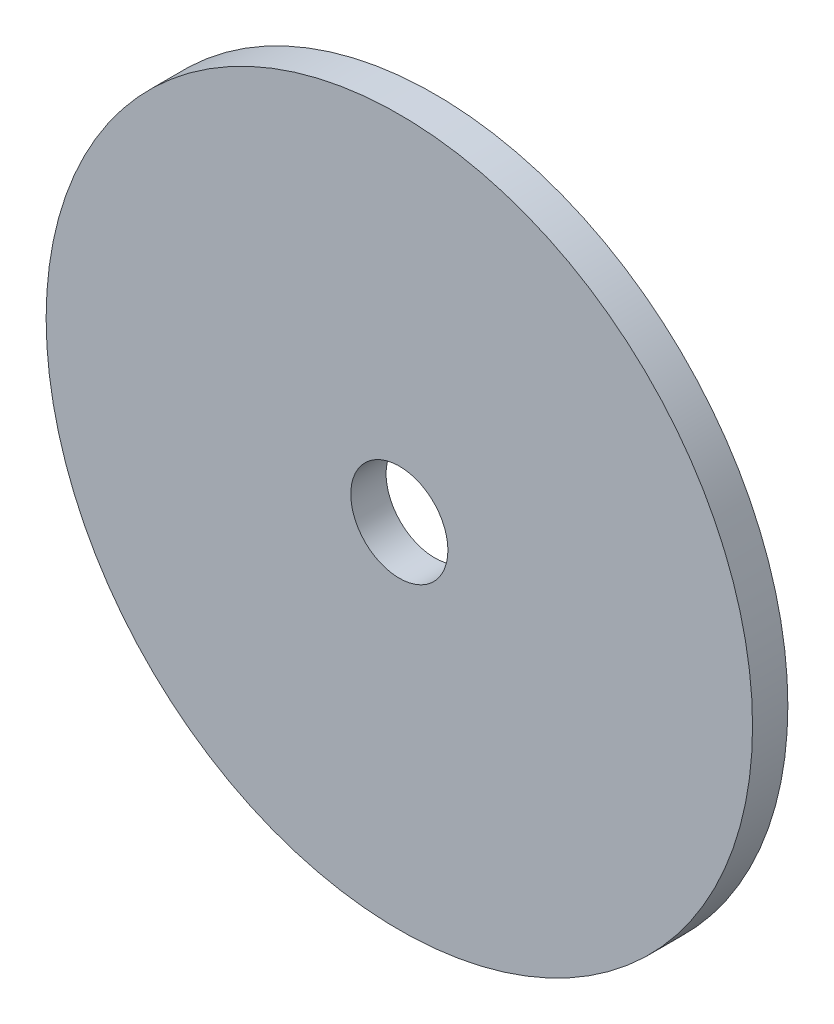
from build123d import *

# Parameters (mm, degrees)
SKETCH1_R           = 25.4
SKETCH1_R_2         = 3.4925
BOSS_EXTRUDE1_DEPTH = 2.54


with BuildPart() as part:
    # Sketch1 → Boss-Extrude1 (new body)
    with BuildSketch(Plane.XY):
        Circle(SKETCH1_R)
        Circle(SKETCH1_R_2, mode=Mode.SUBTRACT)
    extrude(amount=BOSS_EXTRUDE1_DEPTH)


solid = part.part
